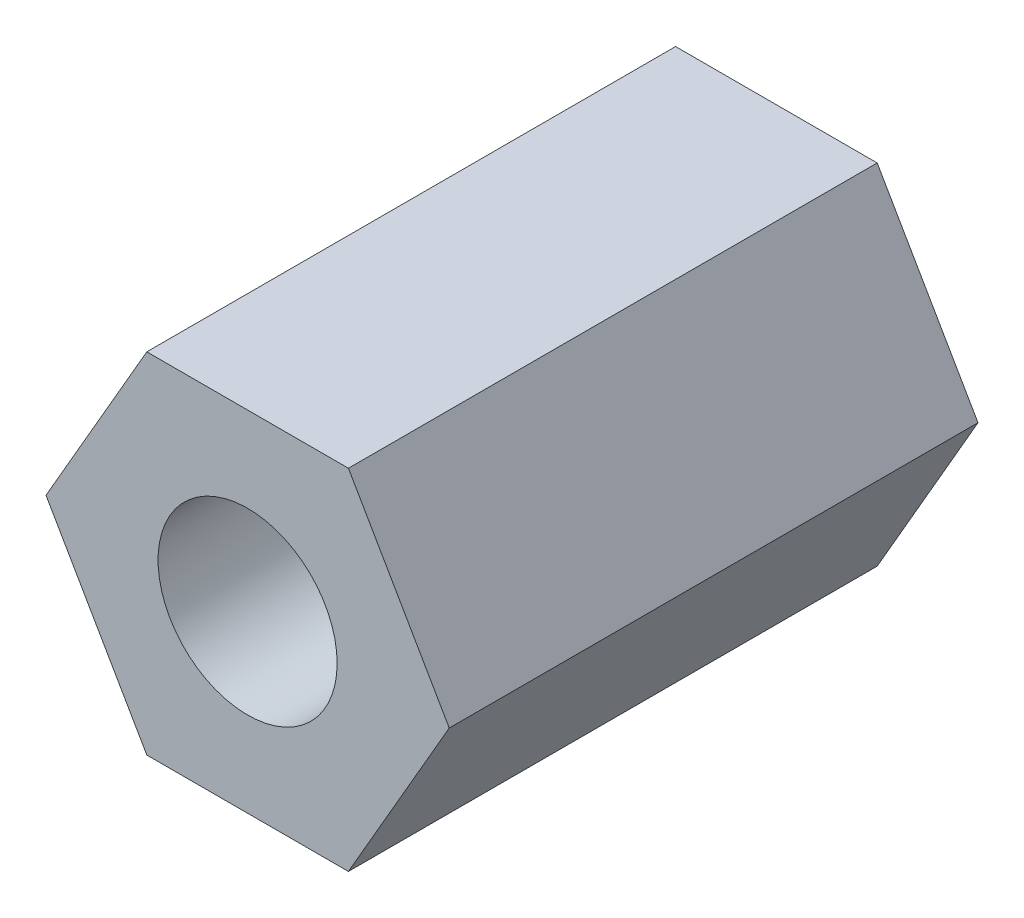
from build123d import *

# Parameters (mm, degrees)
BOSS_EXTRUDE1_DEPTH     = 3
CUT_EXTRUDE1_DEPTH      = 7.720021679
CUT_EXTRUDE1_DEPTH_BACK = 7.720021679
SKETCH5_R               = 1.016


with BuildPart() as part:
    # Sketch1 → Boss-Extrude1 (new, symmetric)
    with BuildSketch(Plane.XY):
        Polygon((1.143846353, 1.9812), (-1.143846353, 1.9812), (-2.287692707, 0), (-1.143846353, -1.9812), (1.143846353, -1.9812), (2.287692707, 0), align=None)
    extrude(amount=BOSS_EXTRUDE1_DEPTH, both=True)

    # Sketch5 → Cut-Extrude1 (cut, two sides: drawn at the far end of the back side and taken through both)
    with BuildSketch(Plane.XY.offset(3).offset(-CUT_EXTRUDE1_DEPTH_BACK)):
        Circle(SKETCH5_R)
    extrude(amount=CUT_EXTRUDE1_DEPTH + CUT_EXTRUDE1_DEPTH_BACK, mode=Mode.SUBTRACT)


solid = part.part
